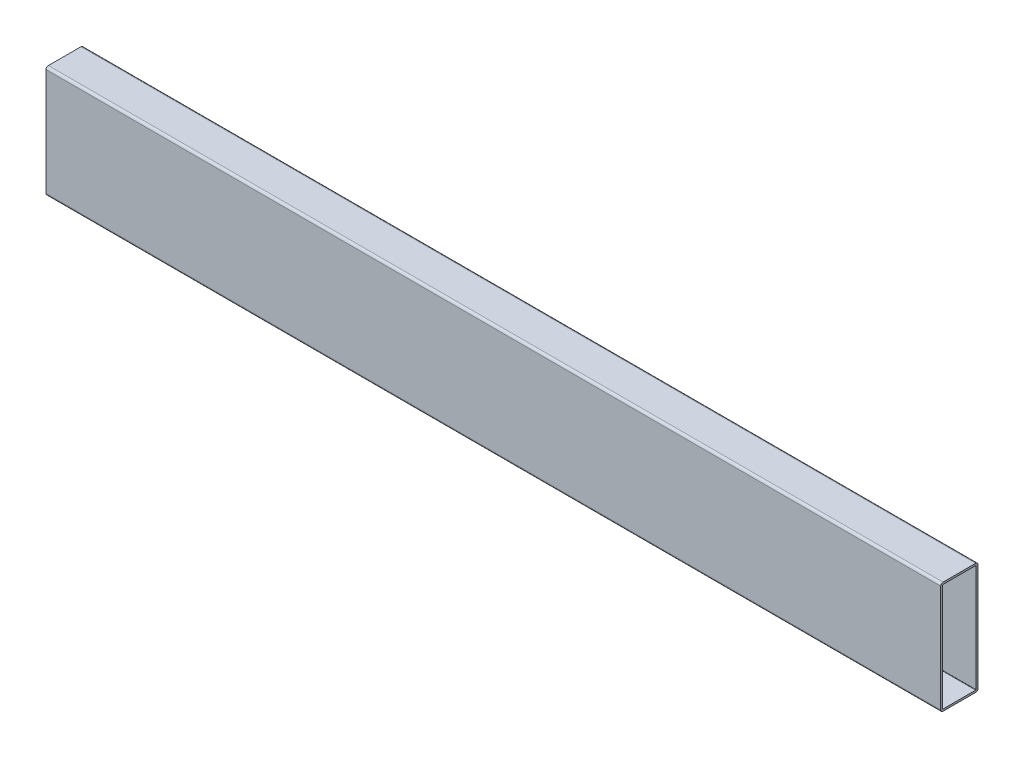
from build123d import *

# Parameters (mm, degrees)
EXTRUDE1_DEPTH = 609.6


with BuildPart() as part:
    # Sketch1 → Extrude1 (new body)
    with BuildSketch(Plane(origin=(0, 0, 0), x_dir=(0, 0, -1), z_dir=(1, 0, 0))):
        with BuildLine():
            Line((-5.373037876, 5.244240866), (16.851962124, 5.244240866))
            ThreePointArc((16.851962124, 5.244240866), (17.974494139, 4.779272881), (18.439462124, 3.656740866))
            Line((18.439462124, 3.656740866), (18.439462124, -69.368259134))
            ThreePointArc((18.439462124, -69.368259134), (17.974494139, -70.490791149), (16.851962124, -70.955759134))
            Line((16.851962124, -70.955759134), (-5.373037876, -70.955759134))
            ThreePointArc((-5.373037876, -70.955759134), (-6.495569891, -70.490791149), (-6.960537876, -69.368259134))
            Line((-6.960537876, -69.368259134), (-6.960537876, 3.656740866))
            ThreePointArc((-6.960537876, 3.656740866), (-6.495569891, 4.779272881), (-5.373037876, 5.244240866))
        make_face()
        with BuildLine():
            Line((-5.373037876, 3.898040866), (16.851962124, 3.898040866))
            ThreePointArc((16.851962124, 3.898040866), (17.02258699, 3.827365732), (17.093262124, 3.656740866))
            Line((17.093262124, 3.656740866), (17.093262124, -69.368259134))
            ThreePointArc((17.093262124, -69.368259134), (17.02258699, -69.538884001), (16.851962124, -69.609559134))
            Line((16.851962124, -69.609559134), (-5.373037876, -69.609559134))
            ThreePointArc((-5.373037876, -69.609559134), (-5.543662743, -69.538884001), (-5.614337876, -69.368259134))
            Line((-5.614337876, -69.368259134), (-5.614337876, 3.656740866))
            ThreePointArc((-5.614337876, 3.656740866), (-5.543662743, 3.827365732), (-5.373037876, 3.898040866))
        make_face(mode=Mode.SUBTRACT)
    extrude(amount=EXTRUDE1_DEPTH)


solid = part.part
